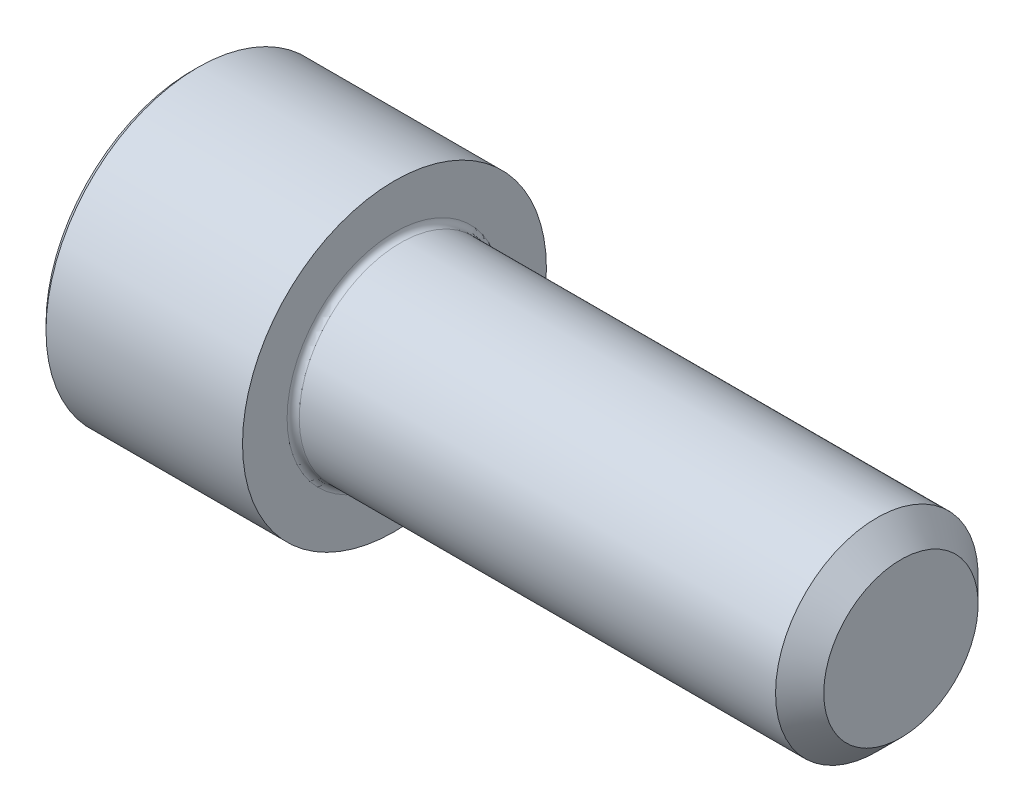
ISO-10303-21;
HEADER;
FILE_DESCRIPTION(('STEP AP214'),'2;1');
FILE_NAME('part.step','',(''),(''),'','','');
FILE_SCHEMA(('AUTOMOTIVE_DESIGN { 1 0 10303 214 1 1 1 1 }'));
ENDSEC;
DATA;
#1=APPLICATION_CONTEXT('core data for automotive mechanical design processes');
#2=APPLICATION_PROTOCOL_DEFINITION('international standard','automotive_design',2000,#1);
#3=PRODUCT_CONTEXT('',#1,'mechanical');
#4=PRODUCT('Part','Part','',(#3));
#5=PRODUCT_RELATED_PRODUCT_CATEGORY('part','',(#4));
#6=PRODUCT_DEFINITION_FORMATION('','',#4);
#7=PRODUCT_DEFINITION_CONTEXT('part definition',#1,'design');
#8=PRODUCT_DEFINITION('design','',#6,#7);
#9=PRODUCT_DEFINITION_SHAPE('','',#8);
#10=(LENGTH_UNIT() NAMED_UNIT(*) SI_UNIT(.MILLI.,.METRE.));
#11=(NAMED_UNIT(*) PLANE_ANGLE_UNIT() SI_UNIT($,.RADIAN.));
#12=(NAMED_UNIT(*) SI_UNIT($,.STERADIAN.) SOLID_ANGLE_UNIT());
#13=UNCERTAINTY_MEASURE_WITH_UNIT(LENGTH_MEASURE(1.E-05),#10,'distance_accuracy_value','');
#14=(GEOMETRIC_REPRESENTATION_CONTEXT(3) GLOBAL_UNCERTAINTY_ASSIGNED_CONTEXT((#13)) GLOBAL_UNIT_ASSIGNED_CONTEXT((#10,
#11,#12)) REPRESENTATION_CONTEXT('',''));
#15=CARTESIAN_POINT('',(0.,0.,0.));
#16=DIRECTION('',(0.,0.,1.));
#17=DIRECTION('',(1.,0.,0.));
#18=AXIS2_PLACEMENT_3D('',#15,#16,#17);
#19=CARTESIAN_POINT('',(-3.302,0.,0.));
#20=DIRECTION('',(1.,0.,0.));
#21=DIRECTION('',(0.,0.,-1.));
#22=AXIS2_PLACEMENT_3D('',#19,#20,#21);
#23=PLANE('',#22);
#24=CARTESIAN_POINT('',(-3.302,0.,0.));
#25=DIRECTION('',(-1.,0.,0.));
#26=DIRECTION('',(0.,0.,1.));
#27=AXIS2_PLACEMENT_3D('',#24,#25,#26);
#28=CIRCLE('',#27,2.38125);
#29=CARTESIAN_POINT('',(-3.302,0.,2.38125));
#30=VERTEX_POINT('',#29);
#31=CARTESIAN_POINT('',(-3.302,2.06222299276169,1.190625));
#32=VERTEX_POINT('',#31);
#33=EDGE_CURVE('E50',#30,#32,#28,.T.);
#34=ORIENTED_EDGE('',*,*,#33,.F.);
#35=DIRECTION('',(0.,-1.,0.));
#36=VECTOR('',#35,1.);
#37=CARTESIAN_POINT('',(-3.302,1.3748153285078,2.38125));
#38=LINE('',#37,#36);
#39=CARTESIAN_POINT('',(-3.302,1.3748153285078,2.38125));
#40=VERTEX_POINT('',#39);
#41=EDGE_CURVE('E163',#40,#30,#38,.T.);
#42=ORIENTED_EDGE('',*,*,#41,.F.);
#43=DIRECTION('',(0.,-0.500000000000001,0.866025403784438));
#44=VECTOR('',#43,1.);
#45=CARTESIAN_POINT('',(-3.302,2.7496306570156,0.));
#46=LINE('',#45,#44);
#47=EDGE_CURVE('E199',#32,#40,#46,.T.);
#48=ORIENTED_EDGE('',*,*,#47,.F.);
#49=EDGE_LOOP('',(#34,#42,#48));
#50=FACE_BOUND('',#49,.T.);
#51=ADVANCED_FACE('F39',(#50),#23,.F.);
#52=CARTESIAN_POINT('',(-3.302,2.06222299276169,-1.190625));
#53=VERTEX_POINT('',#52);
#54=EDGE_CURVE('E11',#32,#53,#28,.T.);
#55=ORIENTED_EDGE('',*,*,#54,.F.);
#56=CARTESIAN_POINT('',(-3.302,2.7496306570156,0.));
#57=VERTEX_POINT('',#56);
#58=EDGE_CURVE('E297',#57,#32,#46,.T.);
#59=ORIENTED_EDGE('',*,*,#58,.F.);
#60=DIRECTION('',(0.,0.500000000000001,0.866025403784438));
#61=VECTOR('',#60,1.);
#62=CARTESIAN_POINT('',(-3.302,1.3748153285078,-2.38125));
#63=LINE('',#62,#61);
#64=EDGE_CURVE('E178',#53,#57,#63,.T.);
#65=ORIENTED_EDGE('',*,*,#64,.F.);
#66=EDGE_LOOP('',(#55,#59,#65));
#67=FACE_BOUND('',#66,.T.);
#68=ADVANCED_FACE('F127',(#67),#23,.F.);
#69=CARTESIAN_POINT('',(-3.302,0.,-2.38125));
#70=VERTEX_POINT('',#69);
#71=EDGE_CURVE('E48',#53,#70,#28,.T.);
#72=ORIENTED_EDGE('',*,*,#71,.F.);
#73=CARTESIAN_POINT('',(-3.302,1.3748153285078,-2.38125));
#74=VERTEX_POINT('',#73);
#75=EDGE_CURVE('E179',#74,#53,#63,.T.);
#76=ORIENTED_EDGE('',*,*,#75,.F.);
#77=DIRECTION('',(0.,1.,0.));
#78=VECTOR('',#77,1.);
#79=CARTESIAN_POINT('',(-3.302,-1.3748153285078,-2.38125));
#80=LINE('',#79,#78);
#81=EDGE_CURVE('E174',#70,#74,#80,.T.);
#82=ORIENTED_EDGE('',*,*,#81,.F.);
#83=EDGE_LOOP('',(#72,#76,#82));
#84=FACE_BOUND('',#83,.T.);
#85=ADVANCED_FACE('F133',(#84),#23,.F.);
#86=CARTESIAN_POINT('',(-3.302,-2.06222299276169,-1.190625));
#87=VERTEX_POINT('',#86);
#88=EDGE_CURVE('E287',#70,#87,#28,.T.);
#89=ORIENTED_EDGE('',*,*,#88,.F.);
#90=CARTESIAN_POINT('',(-3.302,-1.3748153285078,-2.38125));
#91=VERTEX_POINT('',#90);
#92=EDGE_CURVE('E175',#91,#70,#80,.T.);
#93=ORIENTED_EDGE('',*,*,#92,.F.);
#94=DIRECTION('',(0.,0.500000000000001,-0.866025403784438));
#95=VECTOR('',#94,1.);
#96=CARTESIAN_POINT('',(-3.302,-2.7496306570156,0.));
#97=LINE('',#96,#95);
#98=EDGE_CURVE('E169',#87,#91,#97,.T.);
#99=ORIENTED_EDGE('',*,*,#98,.F.);
#100=EDGE_LOOP('',(#89,#93,#99));
#101=FACE_BOUND('',#100,.T.);
#102=ADVANCED_FACE('F146',(#101),#23,.F.);
#103=CARTESIAN_POINT('',(-3.302,-2.0622229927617,1.190625));
#104=VERTEX_POINT('',#103);
#105=EDGE_CURVE('E57',#87,#104,#28,.T.);
#106=ORIENTED_EDGE('',*,*,#105,.F.);
#107=CARTESIAN_POINT('',(-3.302,-2.7496306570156,0.));
#108=VERTEX_POINT('',#107);
#109=EDGE_CURVE('E160',#108,#87,#97,.T.);
#110=ORIENTED_EDGE('',*,*,#109,.F.);
#111=DIRECTION('',(0.,-0.500000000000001,-0.866025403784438));
#112=VECTOR('',#111,1.);
#113=CARTESIAN_POINT('',(-3.302,-1.3748153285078,2.38125));
#114=LINE('',#113,#112);
#115=EDGE_CURVE('E157',#104,#108,#114,.T.);
#116=ORIENTED_EDGE('',*,*,#115,.F.);
#117=EDGE_LOOP('',(#106,#110,#116));
#118=FACE_BOUND('',#117,.T.);
#119=ADVANCED_FACE('F138',(#118),#23,.F.);
#120=EDGE_CURVE('E150',#104,#30,#28,.T.);
#121=ORIENTED_EDGE('',*,*,#120,.F.);
#122=CARTESIAN_POINT('',(-3.302,-1.3748153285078,2.38125));
#123=VERTEX_POINT('',#122);
#124=EDGE_CURVE('E153',#123,#104,#114,.T.);
#125=ORIENTED_EDGE('',*,*,#124,.F.);
#126=EDGE_CURVE('E154',#30,#123,#38,.T.);
#127=ORIENTED_EDGE('',*,*,#126,.F.);
#128=EDGE_LOOP('',(#121,#125,#127));
#129=FACE_BOUND('',#128,.T.);
#130=ADVANCED_FACE('F129',(#129),#23,.F.);
#131=CARTESIAN_POINT('',(-6.35,0.,0.));
#132=DIRECTION('',(1.,0.,0.));
#133=DIRECTION('',(0.,0.,-1.));
#134=AXIS2_PLACEMENT_3D('',#131,#132,#133);
#135=PLANE('',#134);
#136=CARTESIAN_POINT('',(-6.35,0.,0.));
#137=DIRECTION('',(-1.,0.,0.));
#138=DIRECTION('',(0.,0.,1.));
#139=AXIS2_PLACEMENT_3D('',#136,#137,#138);
#140=CIRCLE('',#139,4.572);
#141=CARTESIAN_POINT('',(-6.35,0.,4.572));
#142=VERTEX_POINT('',#141);
#143=EDGE_CURVE('E210',#142,#142,#140,.T.);
#144=ORIENTED_EDGE('',*,*,#143,.T.);
#145=EDGE_LOOP('',(#144));
#146=FACE_BOUND('',#145,.T.);
#147=DIRECTION('',(0.,-0.500000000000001,0.866025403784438));
#148=VECTOR('',#147,1.);
#149=CARTESIAN_POINT('',(-6.35,2.7496306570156,0.));
#150=LINE('',#149,#148);
#151=CARTESIAN_POINT('',(-6.35,2.7496306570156,0.));
#152=VERTEX_POINT('',#151);
#153=CARTESIAN_POINT('',(-6.35,1.3748153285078,2.38125));
#154=VERTEX_POINT('',#153);
#155=EDGE_CURVE('E65',#152,#154,#150,.T.);
#156=ORIENTED_EDGE('',*,*,#155,.T.);
#157=DIRECTION('',(0.,-1.,0.));
#158=VECTOR('',#157,1.);
#159=CARTESIAN_POINT('',(-6.35,1.3748153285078,2.38125));
#160=LINE('',#159,#158);
#161=CARTESIAN_POINT('',(-6.35,-1.3748153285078,2.38125));
#162=VERTEX_POINT('',#161);
#163=EDGE_CURVE('E184',#154,#162,#160,.T.);
#164=ORIENTED_EDGE('',*,*,#163,.T.);
#165=DIRECTION('',(0.,-0.500000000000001,-0.866025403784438));
#166=VECTOR('',#165,1.);
#167=CARTESIAN_POINT('',(-6.35,-1.3748153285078,2.38125));
#168=LINE('',#167,#166);
#169=CARTESIAN_POINT('',(-6.35,-2.7496306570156,0.));
#170=VERTEX_POINT('',#169);
#171=EDGE_CURVE('E187',#162,#170,#168,.T.);
#172=ORIENTED_EDGE('',*,*,#171,.T.);
#173=DIRECTION('',(0.,0.500000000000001,-0.866025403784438));
#174=VECTOR('',#173,1.);
#175=CARTESIAN_POINT('',(-6.35,-2.7496306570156,0.));
#176=LINE('',#175,#174);
#177=CARTESIAN_POINT('',(-6.35,-1.3748153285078,-2.38125));
#178=VERTEX_POINT('',#177);
#179=EDGE_CURVE('E190',#170,#178,#176,.T.);
#180=ORIENTED_EDGE('',*,*,#179,.T.);
#181=DIRECTION('',(0.,1.,0.));
#182=VECTOR('',#181,1.);
#183=CARTESIAN_POINT('',(-6.35,-1.3748153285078,-2.38125));
#184=LINE('',#183,#182);
#185=CARTESIAN_POINT('',(-6.35,1.3748153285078,-2.38125));
#186=VERTEX_POINT('',#185);
#187=EDGE_CURVE('E193',#178,#186,#184,.T.);
#188=ORIENTED_EDGE('',*,*,#187,.T.);
#189=DIRECTION('',(0.,0.500000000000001,0.866025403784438));
#190=VECTOR('',#189,1.);
#191=CARTESIAN_POINT('',(-6.35,1.3748153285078,-2.38125));
#192=LINE('',#191,#190);
#193=EDGE_CURVE('E196',#186,#152,#192,.T.);
#194=ORIENTED_EDGE('',*,*,#193,.T.);
#195=EDGE_LOOP('',(#156,#164,#172,#180,#188,#194));
#196=FACE_BOUND('',#195,.T.);
#197=ADVANCED_FACE('F137',(#146,#196),#135,.F.);
#198=CARTESIAN_POINT('',(15.875,2.41935,0.));
#199=DIRECTION('',(-1.,0.,0.));
#200=DIRECTION('',(0.,0.,1.));
#201=AXIS2_PLACEMENT_3D('',#198,#199,#200);
#202=PLANE('',#201);
#203=CARTESIAN_POINT('',(15.875,0.,0.));
#204=DIRECTION('',(-1.,0.,0.));
#205=DIRECTION('',(0.,0.,1.));
#206=AXIS2_PLACEMENT_3D('',#203,#204,#205);
#207=CIRCLE('',#206,2.41935);
#208=CARTESIAN_POINT('',(15.875,0.,2.41935));
#209=VERTEX_POINT('',#208);
#210=EDGE_CURVE('E43',#209,#209,#207,.T.);
#211=ORIENTED_EDGE('',*,*,#210,.F.);
#212=EDGE_LOOP('',(#211));
#213=FACE_BOUND('',#212,.T.);
#214=ADVANCED_FACE('F41',(#213),#202,.F.);
#215=CARTESIAN_POINT('',(15.875,0.,0.));
#216=DIRECTION('',(-1.,0.,0.));
#217=DIRECTION('',(0.,0.,1.));
#218=AXIS2_PLACEMENT_3D('',#215,#216,#217);
#219=CONICAL_SURFACE('',#218,2.41935,0.785398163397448);
#220=CARTESIAN_POINT('',(15.11935,0.,0.));
#221=DIRECTION('',(-1.,0.,0.));
#222=DIRECTION('',(0.,0.,1.));
#223=AXIS2_PLACEMENT_3D('',#220,#221,#222);
#224=CIRCLE('',#223,3.175);
#225=CARTESIAN_POINT('',(15.11935,0.,3.175));
#226=VERTEX_POINT('',#225);
#227=EDGE_CURVE('E224',#226,#226,#224,.T.);
#228=ORIENTED_EDGE('',*,*,#227,.F.);
#229=EDGE_LOOP('',(#228));
#230=FACE_BOUND('',#229,.T.);
#231=ORIENTED_EDGE('',*,*,#210,.T.);
#232=EDGE_LOOP('',(#231));
#233=FACE_BOUND('',#232,.T.);
#234=ADVANCED_FACE('F231',(#230,#233),#219,.T.);
#235=CARTESIAN_POINT('',(15.875,0.,0.));
#236=DIRECTION('',(-1.,0.,0.));
#237=DIRECTION('',(0.,0.,1.));
#238=AXIS2_PLACEMENT_3D('',#235,#236,#237);
#239=CYLINDRICAL_SURFACE('',#238,3.175);
#240=CARTESIAN_POINT('',(0.1905,0.,0.));
#241=DIRECTION('',(-1.,0.,0.));
#242=DIRECTION('',(0.,0.,1.));
#243=AXIS2_PLACEMENT_3D('',#240,#241,#242);
#244=CIRCLE('',#243,3.175);
#245=CARTESIAN_POINT('',(0.1905,0.,3.175));
#246=VERTEX_POINT('',#245);
#247=EDGE_CURVE('E222',#246,#246,#244,.T.);
#248=ORIENTED_EDGE('',*,*,#247,.F.);
#249=EDGE_LOOP('',(#248));
#250=FACE_BOUND('',#249,.T.);
#251=ORIENTED_EDGE('',*,*,#227,.T.);
#252=EDGE_LOOP('',(#251));
#253=FACE_BOUND('',#252,.T.);
#254=ADVANCED_FACE('F237',(#250,#253),#239,.T.);
#255=CARTESIAN_POINT('',(0.190500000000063,0.,0.));
#256=DIRECTION('',(-1.,0.,0.));
#257=DIRECTION('',(0.,0.,1.));
#258=AXIS2_PLACEMENT_3D('',#255,#256,#257);
#259=TOROIDAL_SURFACE('',#258,3.36550000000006,0.190500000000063);
#260=CARTESIAN_POINT('',(0.,0.,0.));
#261=DIRECTION('',(-1.,0.,0.));
#262=DIRECTION('',(0.,0.,1.));
#263=AXIS2_PLACEMENT_3D('',#260,#261,#262);
#264=CIRCLE('',#263,3.3655);
#265=CARTESIAN_POINT('',(0.,0.,3.3655));
#266=VERTEX_POINT('',#265);
#267=EDGE_CURVE('E219',#266,#266,#264,.T.);
#268=ORIENTED_EDGE('',*,*,#267,.F.);
#269=EDGE_LOOP('',(#268));
#270=FACE_BOUND('',#269,.T.);
#271=ORIENTED_EDGE('',*,*,#247,.T.);
#272=EDGE_LOOP('',(#271));
#273=FACE_BOUND('',#272,.T.);
#274=ADVANCED_FACE('F242',(#270,#273),#259,.F.);
#275=CARTESIAN_POINT('',(0.,4.7625,0.));
#276=DIRECTION('',(-1.,0.,0.));
#277=DIRECTION('',(0.,0.,1.));
#278=AXIS2_PLACEMENT_3D('',#275,#276,#277);
#279=PLANE('',#278);
#280=CARTESIAN_POINT('',(0.,0.,0.));
#281=DIRECTION('',(-1.,0.,0.));
#282=DIRECTION('',(0.,0.,1.));
#283=AXIS2_PLACEMENT_3D('',#280,#281,#282);
#284=CIRCLE('',#283,4.7625);
#285=CARTESIAN_POINT('',(0.,0.,4.7625));
#286=VERTEX_POINT('',#285);
#287=EDGE_CURVE('E216',#286,#286,#284,.T.);
#288=ORIENTED_EDGE('',*,*,#287,.F.);
#289=EDGE_LOOP('',(#288));
#290=FACE_BOUND('',#289,.T.);
#291=ORIENTED_EDGE('',*,*,#267,.T.);
#292=EDGE_LOOP('',(#291));
#293=FACE_BOUND('',#292,.T.);
#294=ADVANCED_FACE('F248',(#290,#293),#279,.F.);
#295=CARTESIAN_POINT('',(15.875,0.,0.));
#296=DIRECTION('',(-1.,0.,0.));
#297=DIRECTION('',(0.,0.,1.));
#298=AXIS2_PLACEMENT_3D('',#295,#296,#297);
#299=CYLINDRICAL_SURFACE('',#298,4.7625);
#300=CARTESIAN_POINT('',(-6.1595,0.,0.));
#301=DIRECTION('',(-1.,0.,0.));
#302=DIRECTION('',(0.,0.,1.));
#303=AXIS2_PLACEMENT_3D('',#300,#301,#302);
#304=CIRCLE('',#303,4.7625);
#305=CARTESIAN_POINT('',(-6.1595,0.,4.7625));
#306=VERTEX_POINT('',#305);
#307=EDGE_CURVE('E213',#306,#306,#304,.T.);
#308=ORIENTED_EDGE('',*,*,#307,.F.);
#309=EDGE_LOOP('',(#308));
#310=FACE_BOUND('',#309,.T.);
#311=ORIENTED_EDGE('',*,*,#287,.T.);
#312=EDGE_LOOP('',(#311));
#313=FACE_BOUND('',#312,.T.);
#314=ADVANCED_FACE('F252',(#310,#313),#299,.T.);
#315=CARTESIAN_POINT('',(-6.1595,0.,0.));
#316=DIRECTION('',(1.,0.,0.));
#317=DIRECTION('',(0.,0.,-1.));
#318=AXIS2_PLACEMENT_3D('',#315,#316,#317);
#319=CONICAL_SURFACE('',#318,4.7625,0.785398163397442);
#320=ORIENTED_EDGE('',*,*,#143,.F.);
#321=EDGE_LOOP('',(#320));
#322=FACE_BOUND('',#321,.T.);
#323=ORIENTED_EDGE('',*,*,#307,.T.);
#324=EDGE_LOOP('',(#323));
#325=FACE_BOUND('',#324,.T.);
#326=ADVANCED_FACE('F256',(#322,#325),#319,.T.);
#327=CARTESIAN_POINT('',(-3.302,2.7496306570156,0.));
#328=DIRECTION('',(0.,-0.866025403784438,-0.500000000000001));
#329=DIRECTION('',(0.,0.500000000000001,-0.866025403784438));
#330=AXIS2_PLACEMENT_3D('',#327,#328,#329);
#331=PLANE('',#330);
#332=ORIENTED_EDGE('',*,*,#155,.F.);
#333=DIRECTION('',(-1.,0.,0.));
#334=VECTOR('',#333,1.);
#335=CARTESIAN_POINT('',(-3.302,2.7496306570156,0.));
#336=LINE('',#335,#334);
#337=EDGE_CURVE('E182',#57,#152,#336,.T.);
#338=ORIENTED_EDGE('',*,*,#337,.F.);
#339=ORIENTED_EDGE('',*,*,#58,.T.);
#340=ORIENTED_EDGE('',*,*,#47,.T.);
#341=DIRECTION('',(-1.,0.,0.));
#342=VECTOR('',#341,1.);
#343=CARTESIAN_POINT('',(-3.302,1.3748153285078,2.38125));
#344=LINE('',#343,#342);
#345=EDGE_CURVE('E208',#40,#154,#344,.T.);
#346=ORIENTED_EDGE('',*,*,#345,.T.);
#347=EDGE_LOOP('',(#332,#338,#339,#340,#346));
#348=FACE_BOUND('',#347,.T.);
#349=ADVANCED_FACE('F259',(#348),#331,.T.);
#350=CARTESIAN_POINT('',(-3.302,1.3748153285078,2.38125));
#351=DIRECTION('',(0.,0.,-1.));
#352=DIRECTION('',(-1.,0.,0.));
#353=AXIS2_PLACEMENT_3D('',#350,#351,#352);
#354=PLANE('',#353);
#355=ORIENTED_EDGE('',*,*,#163,.F.);
#356=ORIENTED_EDGE('',*,*,#345,.F.);
#357=ORIENTED_EDGE('',*,*,#41,.T.);
#358=ORIENTED_EDGE('',*,*,#126,.T.);
#359=DIRECTION('',(-1.,0.,0.));
#360=VECTOR('',#359,1.);
#361=CARTESIAN_POINT('',(-3.302,-1.3748153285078,2.38125));
#362=LINE('',#361,#360);
#363=EDGE_CURVE('E168',#123,#162,#362,.T.);
#364=ORIENTED_EDGE('',*,*,#363,.T.);
#365=EDGE_LOOP('',(#355,#356,#357,#358,#364));
#366=FACE_BOUND('',#365,.T.);
#367=ADVANCED_FACE('F264',(#366),#354,.T.);
#368=CARTESIAN_POINT('',(-3.302,-1.3748153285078,2.38125));
#369=DIRECTION('',(0.,0.866025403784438,-0.500000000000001));
#370=DIRECTION('',(0.,0.500000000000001,0.866025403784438));
#371=AXIS2_PLACEMENT_3D('',#368,#369,#370);
#372=PLANE('',#371);
#373=ORIENTED_EDGE('',*,*,#171,.F.);
#374=ORIENTED_EDGE('',*,*,#363,.F.);
#375=ORIENTED_EDGE('',*,*,#124,.T.);
#376=ORIENTED_EDGE('',*,*,#115,.T.);
#377=DIRECTION('',(-1.,0.,0.));
#378=VECTOR('',#377,1.);
#379=CARTESIAN_POINT('',(-3.302,-2.7496306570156,0.));
#380=LINE('',#379,#378);
#381=EDGE_CURVE('E205',#108,#170,#380,.T.);
#382=ORIENTED_EDGE('',*,*,#381,.T.);
#383=EDGE_LOOP('',(#373,#374,#375,#376,#382));
#384=FACE_BOUND('',#383,.T.);
#385=ADVANCED_FACE('F167',(#384),#372,.T.);
#386=CARTESIAN_POINT('',(-3.302,-2.7496306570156,0.));
#387=DIRECTION('',(0.,0.866025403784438,0.500000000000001));
#388=DIRECTION('',(0.,-0.500000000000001,0.866025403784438));
#389=AXIS2_PLACEMENT_3D('',#386,#387,#388);
#390=PLANE('',#389);
#391=ORIENTED_EDGE('',*,*,#179,.F.);
#392=ORIENTED_EDGE('',*,*,#381,.F.);
#393=ORIENTED_EDGE('',*,*,#109,.T.);
#394=ORIENTED_EDGE('',*,*,#98,.T.);
#395=DIRECTION('',(-1.,0.,0.));
#396=VECTOR('',#395,1.);
#397=CARTESIAN_POINT('',(-3.302,-1.3748153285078,-2.38125));
#398=LINE('',#397,#396);
#399=EDGE_CURVE('E203',#91,#178,#398,.T.);
#400=ORIENTED_EDGE('',*,*,#399,.T.);
#401=EDGE_LOOP('',(#391,#392,#393,#394,#400));
#402=FACE_BOUND('',#401,.T.);
#403=ADVANCED_FACE('F270',(#402),#390,.T.);
#404=CARTESIAN_POINT('',(-3.302,-1.3748153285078,-2.38125));
#405=DIRECTION('',(0.,0.,1.));
#406=DIRECTION('',(1.,0.,0.));
#407=AXIS2_PLACEMENT_3D('',#404,#405,#406);
#408=PLANE('',#407);
#409=ORIENTED_EDGE('',*,*,#187,.F.);
#410=ORIENTED_EDGE('',*,*,#399,.F.);
#411=ORIENTED_EDGE('',*,*,#92,.T.);
#412=ORIENTED_EDGE('',*,*,#81,.T.);
#413=DIRECTION('',(-1.,0.,0.));
#414=VECTOR('',#413,1.);
#415=CARTESIAN_POINT('',(-3.302,1.3748153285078,-2.38125));
#416=LINE('',#415,#414);
#417=EDGE_CURVE('E201',#74,#186,#416,.T.);
#418=ORIENTED_EDGE('',*,*,#417,.T.);
#419=EDGE_LOOP('',(#409,#410,#411,#412,#418));
#420=FACE_BOUND('',#419,.T.);
#421=ADVANCED_FACE('F122',(#420),#408,.T.);
#422=CARTESIAN_POINT('',(-3.302,1.3748153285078,-2.38125));
#423=DIRECTION('',(0.,-0.866025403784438,0.500000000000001));
#424=DIRECTION('',(0.,-0.500000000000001,-0.866025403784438));
#425=AXIS2_PLACEMENT_3D('',#422,#423,#424);
#426=PLANE('',#425);
#427=ORIENTED_EDGE('',*,*,#193,.F.);
#428=ORIENTED_EDGE('',*,*,#417,.F.);
#429=ORIENTED_EDGE('',*,*,#75,.T.);
#430=ORIENTED_EDGE('',*,*,#64,.T.);
#431=ORIENTED_EDGE('',*,*,#337,.T.);
#432=EDGE_LOOP('',(#427,#428,#429,#430,#431));
#433=FACE_BOUND('',#432,.T.);
#434=ADVANCED_FACE('F117',(#433),#426,.T.);
#435=CARTESIAN_POINT('',(-1.9271846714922,0.,0.));
#436=DIRECTION('',(-1.,0.,0.));
#437=DIRECTION('',(0.,0.,1.));
#438=AXIS2_PLACEMENT_3D('',#435,#436,#437);
#439=CONICAL_SURFACE('',#438,0.,1.0471975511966);
#440=ORIENTED_EDGE('',*,*,#33,.T.);
#441=ORIENTED_EDGE('',*,*,#54,.T.);
#442=ORIENTED_EDGE('',*,*,#71,.T.);
#443=ORIENTED_EDGE('',*,*,#88,.T.);
#444=ORIENTED_EDGE('',*,*,#105,.T.);
#445=ORIENTED_EDGE('',*,*,#120,.T.);
#446=EDGE_LOOP('',(#440,#441,#442,#443,#444,#445));
#447=FACE_BOUND('',#446,.T.);
#448=CARTESIAN_POINT('',(-1.9271846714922,0.,0.));
#449=VERTEX_POINT('',#448);
#450=VERTEX_LOOP('',#449);
#451=FACE_BOUND('',#450,.T.);
#452=ADVANCED_FACE('F115',(#447,#451),#439,.F.);
#453=CLOSED_SHELL('',(#51,#68,#85,#102,#119,#130,#197,#214,#234,#254,#274,#294,#314,#326,#349,
#367,#385,#403,#421,#434,#452));
#454=MANIFOLD_SOLID_BREP('B2',#453);
#455=ADVANCED_BREP_SHAPE_REPRESENTATION('',(#18,#454),#14);
#456=SHAPE_DEFINITION_REPRESENTATION(#9,#455);
ENDSEC;
END-ISO-10303-21;
